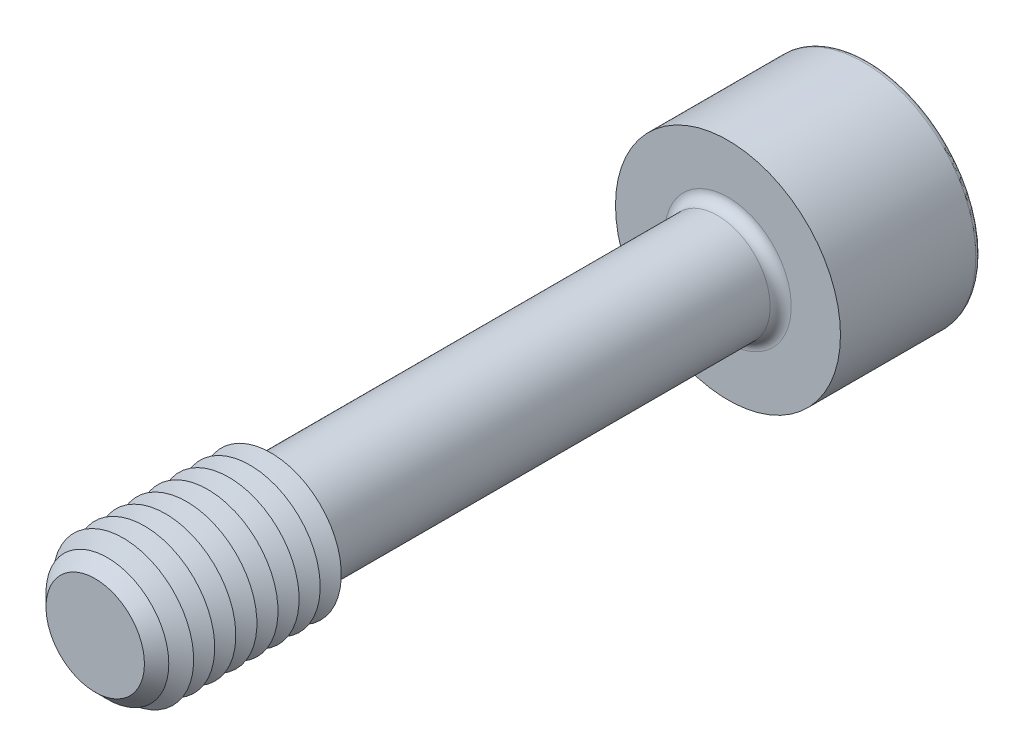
from build123d import *

# Parameters (mm, degrees)
SKETCH1_R       = 3.75
EXTRUDE1_DEPTH  = 22.5
CHAMFER1_SIZE   = 1.5
SKETCH3_R       = 8
EXTRUDE2_DEPTH  = 10
EXTRUDE3_DEPTH  = 8
FILLET1_R       = 0.75
FILLET2_R       = 0.375
LPATTERN1_COUNT = 8
LPATTERN1_PITCH = 1.5


with BuildPart() as part:
    # Sketch1 → Extrude1 (new, symmetric)
    with BuildSketch(Plane.XY):
        with Locations(Location((0, 0, 0), (0, 0, 180))):
            Circle(SKETCH1_R)
    extrude(amount=EXTRUDE1_DEPTH, both=True)

    # Sketch2 → Revolve1 (revolve)
    with BuildSketch(Plane(origin=(0, 0, 0), x_dir=(0, 0, -1), z_dir=(1, 0, 0)), mode=Mode.PRIVATE) as revolve1_sk:
        Polygon((-22.5, 0), (-22.5, 5), (-10, 5), (-9.278312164, 3.75), (-9.278312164, 0), align=None)
    revolve(revolve1_sk.sketch.rotate(Axis((0, 0, 9.278312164), (0, 0, 1)), 90), axis=Axis((0, 0, 9.278312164), (0, 0, 1)))

    # Chamfer1
    chamfer1_edges = [part.edges().sort_by_distance(p)[0] for p in [
        (5, 0, 22.5),
    ]]
    chamfer(chamfer1_edges, length=CHAMFER1_SIZE)

    # Sketch3 → Extrude2 (add)
    with BuildSketch(Plane(origin=(0, 0, -22.5), x_dir=(-1, 0, 0), z_dir=(0, 0, -1))):
        Circle(SKETCH3_R)
    extrude(amount=EXTRUDE2_DEPTH)

    # Sketch4 → Extrude3 (cut)
    with BuildSketch(Plane(origin=(-13.7, 0, -32.5), x_dir=(1, 0, 0), z_dir=(0, 0, 1))):
        Polygon((11.390598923, -4), (16.009401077, -4), (18.318802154, 0), (16.009401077, 4), (11.390598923, 4), (9.081197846, 0), align=None)
    extrude(amount=EXTRUDE3_DEPTH, mode=Mode.SUBTRACT)

    # Fillet1
    fillet1_edges = [part.edges().sort_by_distance(p)[0] for p in [
        (3.75, 0, -22.5),
    ]]
    fillet(fillet1_edges, radius=FILLET1_R)

    # Fillet2
    fillet2_edges = [part.edges().sort_by_distance(p)[0] for p in [
        (8, 0, -32.5),
    ]]
    fillet(fillet2_edges, radius=FILLET2_R)

    # Sketch5 → Cut-Revolve1 (revolve, cut)
    with BuildSketch(Plane(origin=(0, 0, 0), x_dir=(0, 0, -1), z_dir=(1, 0, 0)), mode=Mode.PRIVATE) as cut_revolve1_sk:
        Polygon((24.5, 0), (24.5, -4), (22.190598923, 0), align=None)
    revolve(cut_revolve1_sk.sketch.rotate(Axis((0, 0, -22.190598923), (0, 0, -1)), 180), axis=Axis((0, 0, -22.190598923), (0, 0, -1)), mode=Mode.SUBTRACT)

    # Sketch7 → Cut-Revolve2 (revolve, cut)
    with BuildSketch(Plane(origin=(0, 0, 0), x_dir=(0, 0, -1), z_dir=(1, 0, 0)), mode=Mode.PRIVATE) as cut_revolve2_sk:
        Polygon((-10, 5), (-10.75, 3.700961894), (-11.5, 5), align=None)
    cut_revolve2 = revolve(cut_revolve2_sk.sketch.rotate(Axis((0, 0, -1.332048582), (0, 0, 1)), 90), axis=Axis((0, 0, -1.332048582), (0, 0, 1)), mode=Mode.SUBTRACT)

    # LPattern1: Cut-Revolve2 ×8
    with Locations(*[(0, 0, i * LPATTERN1_PITCH) for i in range(1, LPATTERN1_COUNT)]):
        add(cut_revolve2, mode=Mode.SUBTRACT)


solid = part.part
